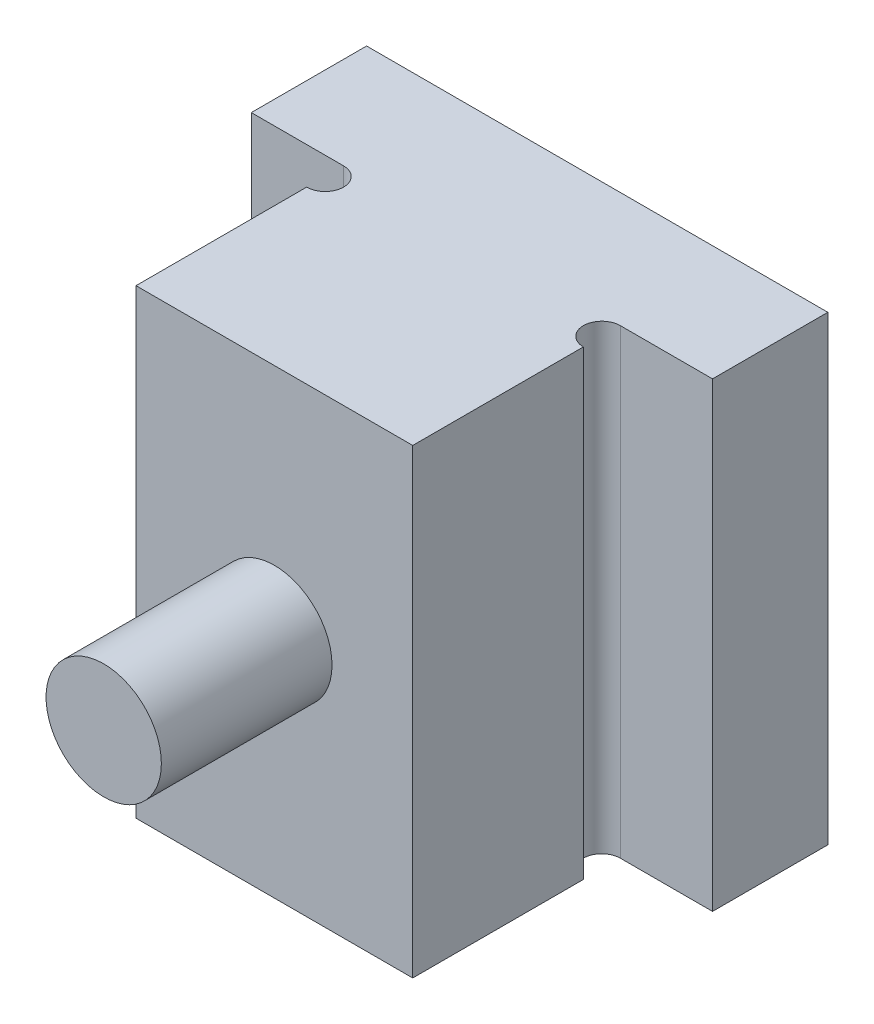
ISO-10303-21;
HEADER;
FILE_DESCRIPTION(('STEP AP214'),'2;1');
FILE_NAME('part.step','',(''),(''),'','','');
FILE_SCHEMA(('AUTOMOTIVE_DESIGN { 1 0 10303 214 1 1 1 1 }'));
ENDSEC;
DATA;
#1=APPLICATION_CONTEXT('core data for automotive mechanical design processes');
#2=APPLICATION_PROTOCOL_DEFINITION('international standard','automotive_design',2000,#1);
#3=PRODUCT_CONTEXT('',#1,'mechanical');
#4=PRODUCT('Part','Part','',(#3));
#5=PRODUCT_RELATED_PRODUCT_CATEGORY('part','',(#4));
#6=PRODUCT_DEFINITION_FORMATION('','',#4);
#7=PRODUCT_DEFINITION_CONTEXT('part definition',#1,'design');
#8=PRODUCT_DEFINITION('design','',#6,#7);
#9=PRODUCT_DEFINITION_SHAPE('','',#8);
#10=(LENGTH_UNIT() NAMED_UNIT(*) SI_UNIT(.MILLI.,.METRE.));
#11=(NAMED_UNIT(*) PLANE_ANGLE_UNIT() SI_UNIT($,.RADIAN.));
#12=(NAMED_UNIT(*) SI_UNIT($,.STERADIAN.) SOLID_ANGLE_UNIT());
#13=UNCERTAINTY_MEASURE_WITH_UNIT(LENGTH_MEASURE(1.E-05),#10,'distance_accuracy_value','');
#14=(GEOMETRIC_REPRESENTATION_CONTEXT(3) GLOBAL_UNCERTAINTY_ASSIGNED_CONTEXT((#13)) GLOBAL_UNIT_ASSIGNED_CONTEXT((#10,
#11,#12)) REPRESENTATION_CONTEXT('',''));
#15=CARTESIAN_POINT('',(0.,0.,0.));
#16=DIRECTION('',(0.,0.,1.));
#17=DIRECTION('',(1.,0.,0.));
#18=AXIS2_PLACEMENT_3D('',#15,#16,#17);
#19=CARTESIAN_POINT('',(-1.15470053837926,2.,-10.05));
#20=DIRECTION('',(0.,0.,1.));
#21=DIRECTION('',(-1.,0.,0.));
#22=AXIS2_PLACEMENT_3D('',#19,#20,#21);
#23=PLANE('',#22);
#24=DIRECTION('',(1.,0.,0.));
#25=VECTOR('',#24,1.);
#26=CARTESIAN_POINT('',(-1.15470053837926,2.,-10.05));
#27=LINE('',#26,#25);
#28=CARTESIAN_POINT('',(-1.15470053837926,2.,-10.05));
#29=VERTEX_POINT('',#28);
#30=CARTESIAN_POINT('',(1.15470053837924,2.,-10.05));
#31=VERTEX_POINT('',#30);
#32=EDGE_CURVE('E128',#29,#31,#27,.T.);
#33=ORIENTED_EDGE('',*,*,#32,.T.);
#34=DIRECTION('',(0.5,-0.866025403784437,0.));
#35=VECTOR('',#34,1.);
#36=CARTESIAN_POINT('',(1.15470053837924,2.,-10.05));
#37=LINE('',#36,#35);
#38=CARTESIAN_POINT('',(2.3094010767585,0.,-10.05));
#39=VERTEX_POINT('',#38);
#40=EDGE_CURVE('E133',#31,#39,#37,.T.);
#41=ORIENTED_EDGE('',*,*,#40,.T.);
#42=DIRECTION('',(0.5,0.866025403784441,0.));
#43=VECTOR('',#42,1.);
#44=CARTESIAN_POINT('',(1.15470053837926,-2.,-10.05));
#45=LINE('',#44,#43);
#46=CARTESIAN_POINT('',(1.15470053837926,-2.,-10.05));
#47=VERTEX_POINT('',#46);
#48=EDGE_CURVE('E184',#47,#39,#45,.T.);
#49=ORIENTED_EDGE('',*,*,#48,.F.);
#50=DIRECTION('',(1.,0.,0.));
#51=VECTOR('',#50,1.);
#52=CARTESIAN_POINT('',(-1.15470053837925,-2.,-10.05));
#53=LINE('',#52,#51);
#54=CARTESIAN_POINT('',(-1.15470053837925,-2.,-10.05));
#55=VERTEX_POINT('',#54);
#56=EDGE_CURVE('E149',#55,#47,#53,.T.);
#57=ORIENTED_EDGE('',*,*,#56,.F.);
#58=DIRECTION('',(-0.5,0.866025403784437,0.));
#59=VECTOR('',#58,1.);
#60=CARTESIAN_POINT('',(-1.15470053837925,-2.,-10.05));
#61=LINE('',#60,#59);
#62=CARTESIAN_POINT('',(-2.30940107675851,0.,-10.05));
#63=VERTEX_POINT('',#62);
#64=EDGE_CURVE('E144',#55,#63,#61,.T.);
#65=ORIENTED_EDGE('',*,*,#64,.T.);
#66=DIRECTION('',(-0.5,-0.866025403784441,0.));
#67=VECTOR('',#66,1.);
#68=CARTESIAN_POINT('',(-1.15470053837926,2.,-10.05));
#69=LINE('',#68,#67);
#70=EDGE_CURVE('E146',#29,#63,#69,.T.);
#71=ORIENTED_EDGE('',*,*,#70,.F.);
#72=EDGE_LOOP('',(#33,#41,#49,#57,#65,#71));
#73=FACE_BOUND('',#72,.T.);
#74=ADVANCED_FACE('F16',(#73),#23,.F.);
#75=CARTESIAN_POINT('',(-1.15470053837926,2.,-10.05));
#76=DIRECTION('',(0.866025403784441,-0.5,0.));
#77=DIRECTION('',(-0.5,-0.866025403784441,0.));
#78=AXIS2_PLACEMENT_3D('',#75,#76,#77);
#79=PLANE('',#78);
#80=ORIENTED_EDGE('',*,*,#70,.T.);
#81=DIRECTION('',(0.,0.,-1.));
#82=VECTOR('',#81,1.);
#83=CARTESIAN_POINT('',(-2.30940107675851,0.,-10.05));
#84=LINE('',#83,#82);
#85=CARTESIAN_POINT('',(-2.30940107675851,0.,-13.6));
#86=VERTEX_POINT('',#85);
#87=EDGE_CURVE('E155',#63,#86,#84,.T.);
#88=ORIENTED_EDGE('',*,*,#87,.T.);
#89=DIRECTION('',(0.5,0.86602540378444,0.));
#90=VECTOR('',#89,1.);
#91=CARTESIAN_POINT('',(-2.30940107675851,0.,-13.6));
#92=LINE('',#91,#90);
#93=CARTESIAN_POINT('',(-1.15470053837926,2.,-13.6));
#94=VERTEX_POINT('',#93);
#95=EDGE_CURVE('E200',#86,#94,#92,.T.);
#96=ORIENTED_EDGE('',*,*,#95,.T.);
#97=DIRECTION('',(0.,0.,-1.));
#98=VECTOR('',#97,1.);
#99=CARTESIAN_POINT('',(-1.15470053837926,2.,-10.05));
#100=LINE('',#99,#98);
#101=EDGE_CURVE('E152',#94,#29,#100,.F.);
#102=ORIENTED_EDGE('',*,*,#101,.T.);
#103=EDGE_LOOP('',(#80,#88,#96,#102));
#104=FACE_BOUND('',#103,.T.);
#105=ADVANCED_FACE('F163',(#104),#79,.T.);
#106=CARTESIAN_POINT('',(-1.15470053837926,2.,-10.05));
#107=DIRECTION('',(0.,1.,0.));
#108=DIRECTION('',(1.,0.,0.));
#109=AXIS2_PLACEMENT_3D('',#106,#107,#108);
#110=PLANE('',#109);
#111=DIRECTION('',(0.,0.,-1.));
#112=VECTOR('',#111,1.);
#113=CARTESIAN_POINT('',(1.15470053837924,2.,-10.05));
#114=LINE('',#113,#112);
#115=CARTESIAN_POINT('',(1.15470053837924,2.,-13.6));
#116=VERTEX_POINT('',#115);
#117=EDGE_CURVE('E190',#116,#31,#114,.F.);
#118=ORIENTED_EDGE('',*,*,#117,.T.);
#119=ORIENTED_EDGE('',*,*,#32,.F.);
#120=ORIENTED_EDGE('',*,*,#101,.F.);
#121=DIRECTION('',(-1.,0.,0.));
#122=VECTOR('',#121,1.);
#123=CARTESIAN_POINT('',(0.,2.,-13.6));
#124=LINE('',#123,#122);
#125=EDGE_CURVE('E161',#94,#116,#124,.F.);
#126=ORIENTED_EDGE('',*,*,#125,.T.);
#127=EDGE_LOOP('',(#118,#119,#120,#126));
#128=FACE_BOUND('',#127,.T.);
#129=ADVANCED_FACE('F342',(#128),#110,.F.);
#130=CARTESIAN_POINT('',(1.15470053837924,2.,-10.05));
#131=DIRECTION('',(0.866025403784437,0.5,0.));
#132=DIRECTION('',(0.5,-0.866025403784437,0.));
#133=AXIS2_PLACEMENT_3D('',#130,#131,#132);
#134=PLANE('',#133);
#135=DIRECTION('',(0.,0.,-1.));
#136=VECTOR('',#135,1.);
#137=CARTESIAN_POINT('',(2.3094010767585,0.,-10.05));
#138=LINE('',#137,#136);
#139=CARTESIAN_POINT('',(2.3094010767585,0.,-13.6));
#140=VERTEX_POINT('',#139);
#141=EDGE_CURVE('E180',#39,#140,#138,.T.);
#142=ORIENTED_EDGE('',*,*,#141,.F.);
#143=ORIENTED_EDGE('',*,*,#40,.F.);
#144=ORIENTED_EDGE('',*,*,#117,.F.);
#145=DIRECTION('',(0.5,-0.866025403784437,0.));
#146=VECTOR('',#145,1.);
#147=CARTESIAN_POINT('',(1.15470053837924,2.,-13.6));
#148=LINE('',#147,#146);
#149=EDGE_CURVE('E593',#116,#140,#148,.T.);
#150=ORIENTED_EDGE('',*,*,#149,.T.);
#151=EDGE_LOOP('',(#142,#143,#144,#150));
#152=FACE_BOUND('',#151,.T.);
#153=ADVANCED_FACE('F545',(#152),#134,.F.);
#154=CARTESIAN_POINT('',(1.15470053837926,-2.,-10.05));
#155=DIRECTION('',(-0.866025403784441,0.5,0.));
#156=DIRECTION('',(0.5,0.866025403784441,0.));
#157=AXIS2_PLACEMENT_3D('',#154,#155,#156);
#158=PLANE('',#157);
#159=ORIENTED_EDGE('',*,*,#48,.T.);
#160=ORIENTED_EDGE('',*,*,#141,.T.);
#161=DIRECTION('',(-0.5,-0.866025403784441,0.));
#162=VECTOR('',#161,1.);
#163=CARTESIAN_POINT('',(2.3094010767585,0.,-13.6));
#164=LINE('',#163,#162);
#165=CARTESIAN_POINT('',(1.15470053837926,-2.,-13.6));
#166=VERTEX_POINT('',#165);
#167=EDGE_CURVE('E596',#140,#166,#164,.T.);
#168=ORIENTED_EDGE('',*,*,#167,.T.);
#169=DIRECTION('',(0.,0.,-1.));
#170=VECTOR('',#169,1.);
#171=CARTESIAN_POINT('',(1.15470053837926,-2.,-10.05));
#172=LINE('',#171,#170);
#173=EDGE_CURVE('E174',#47,#166,#172,.T.);
#174=ORIENTED_EDGE('',*,*,#173,.F.);
#175=EDGE_LOOP('',(#159,#160,#168,#174));
#176=FACE_BOUND('',#175,.T.);
#177=ADVANCED_FACE('F536',(#176),#158,.T.);
#178=CARTESIAN_POINT('',(-1.15470053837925,-2.,-10.05));
#179=DIRECTION('',(0.,1.,0.));
#180=DIRECTION('',(1.,0.,0.));
#181=AXIS2_PLACEMENT_3D('',#178,#179,#180);
#182=PLANE('',#181);
#183=ORIENTED_EDGE('',*,*,#56,.T.);
#184=ORIENTED_EDGE('',*,*,#173,.T.);
#185=DIRECTION('',(-1.,0.,0.));
#186=VECTOR('',#185,1.);
#187=CARTESIAN_POINT('',(0.,-2.,-13.6));
#188=LINE('',#187,#186);
#189=CARTESIAN_POINT('',(-1.15470053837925,-2.,-13.6));
#190=VERTEX_POINT('',#189);
#191=EDGE_CURVE('E598',#166,#190,#188,.T.);
#192=ORIENTED_EDGE('',*,*,#191,.T.);
#193=DIRECTION('',(0.,0.,-1.));
#194=VECTOR('',#193,1.);
#195=CARTESIAN_POINT('',(-1.15470053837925,-2.,-10.05));
#196=LINE('',#195,#194);
#197=EDGE_CURVE('E153',#190,#55,#196,.F.);
#198=ORIENTED_EDGE('',*,*,#197,.T.);
#199=EDGE_LOOP('',(#183,#184,#192,#198));
#200=FACE_BOUND('',#199,.T.);
#201=ADVANCED_FACE('F528',(#200),#182,.T.);
#202=CARTESIAN_POINT('',(-1.15470053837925,-2.,-10.05));
#203=DIRECTION('',(-0.866025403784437,-0.5,0.));
#204=DIRECTION('',(-0.5,0.866025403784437,0.));
#205=AXIS2_PLACEMENT_3D('',#202,#203,#204);
#206=PLANE('',#205);
#207=ORIENTED_EDGE('',*,*,#87,.F.);
#208=ORIENTED_EDGE('',*,*,#64,.F.);
#209=ORIENTED_EDGE('',*,*,#197,.F.);
#210=DIRECTION('',(-0.5,0.866025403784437,0.));
#211=VECTOR('',#210,1.);
#212=CARTESIAN_POINT('',(-1.15470053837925,-2.,-13.6));
#213=LINE('',#212,#211);
#214=EDGE_CURVE('E36',#190,#86,#213,.T.);
#215=ORIENTED_EDGE('',*,*,#214,.T.);
#216=EDGE_LOOP('',(#207,#208,#209,#215));
#217=FACE_BOUND('',#216,.T.);
#218=ADVANCED_FACE('F156',(#217),#206,.F.);
#219=CARTESIAN_POINT('',(0.,-4.05,-13.6));
#220=DIRECTION('',(0.,0.,1.));
#221=DIRECTION('',(-1.,0.,0.));
#222=AXIS2_PLACEMENT_3D('',#219,#220,#221);
#223=PLANE('',#222);
#224=CARTESIAN_POINT('',(0.,0.,-13.6));
#225=DIRECTION('',(0.,0.,1.));
#226=DIRECTION('',(-1.,0.,0.));
#227=AXIS2_PLACEMENT_3D('',#224,#225,#226);
#228=CIRCLE('',#227,4.25);
#229=CARTESIAN_POINT('',(-4.25,0.,-13.6));
#230=VERTEX_POINT('',#229);
#231=EDGE_CURVE('E199',#230,#230,#228,.T.);
#232=ORIENTED_EDGE('',*,*,#231,.F.);
#233=EDGE_LOOP('',(#232));
#234=FACE_BOUND('',#233,.T.);
#235=ORIENTED_EDGE('',*,*,#214,.F.);
#236=ORIENTED_EDGE('',*,*,#191,.F.);
#237=ORIENTED_EDGE('',*,*,#167,.F.);
#238=ORIENTED_EDGE('',*,*,#149,.F.);
#239=ORIENTED_EDGE('',*,*,#125,.F.);
#240=ORIENTED_EDGE('',*,*,#95,.F.);
#241=EDGE_LOOP('',(#235,#236,#237,#238,#239,#240));
#242=FACE_BOUND('',#241,.T.);
#243=ADVANCED_FACE('F347',(#234,#242),#223,.F.);
#244=CARTESIAN_POINT('',(0.,0.,-8.6));
#245=DIRECTION('',(0.,0.,-1.));
#246=DIRECTION('',(1.,0.,0.));
#247=AXIS2_PLACEMENT_3D('',#244,#245,#246);
#248=CYLINDRICAL_SURFACE('',#247,4.25);
#249=CARTESIAN_POINT('',(0.,0.,-8.6));
#250=DIRECTION('',(0.,0.,-1.));
#251=DIRECTION('',(1.,0.,0.));
#252=AXIS2_PLACEMENT_3D('',#249,#250,#251);
#253=CIRCLE('',#252,4.25);
#254=CARTESIAN_POINT('',(4.25,0.,-8.6));
#255=VERTEX_POINT('',#254);
#256=EDGE_CURVE('E195',#255,#255,#253,.T.);
#257=ORIENTED_EDGE('',*,*,#256,.T.);
#258=EDGE_LOOP('',(#257));
#259=FACE_BOUND('',#258,.T.);
#260=ORIENTED_EDGE('',*,*,#231,.T.);
#261=EDGE_LOOP('',(#260));
#262=FACE_BOUND('',#261,.T.);
#263=ADVANCED_FACE('F350',(#259,#262),#248,.T.);
#264=CARTESIAN_POINT('',(10.,-9.99999999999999,-14.));
#265=DIRECTION('',(-1.,0.,0.));
#266=DIRECTION('',(0.,0.,-1.));
#267=AXIS2_PLACEMENT_3D('',#264,#265,#266);
#268=PLANE('',#267);
#269=DIRECTION('',(0.,0.,1.));
#270=VECTOR('',#269,1.);
#271=CARTESIAN_POINT('',(10.,-9.99999999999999,-14.));
#272=LINE('',#271,#270);
#273=CARTESIAN_POINT('',(10.,-9.99999999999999,-9.));
#274=VERTEX_POINT('',#273);
#275=CARTESIAN_POINT('',(10.,-9.99999999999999,-14.));
#276=VERTEX_POINT('',#275);
#277=EDGE_CURVE('E266',#274,#276,#272,.F.);
#278=ORIENTED_EDGE('',*,*,#277,.T.);
#279=DIRECTION('',(0.,1.,0.));
#280=VECTOR('',#279,1.);
#281=CARTESIAN_POINT('',(10.,-9.99999999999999,-14.));
#282=LINE('',#281,#280);
#283=CARTESIAN_POINT('',(10.,9.99999999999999,-14.));
#284=VERTEX_POINT('',#283);
#285=EDGE_CURVE('E297',#276,#284,#282,.T.);
#286=ORIENTED_EDGE('',*,*,#285,.T.);
#287=DIRECTION('',(0.,0.,-1.));
#288=VECTOR('',#287,1.);
#289=CARTESIAN_POINT('',(10.,9.99999999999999,-14.));
#290=LINE('',#289,#288);
#291=CARTESIAN_POINT('',(10.,9.99999999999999,-9.));
#292=VERTEX_POINT('',#291);
#293=EDGE_CURVE('E262',#292,#284,#290,.T.);
#294=ORIENTED_EDGE('',*,*,#293,.F.);
#295=DIRECTION('',(0.,-1.,0.));
#296=VECTOR('',#295,1.);
#297=CARTESIAN_POINT('',(10.,-9.99999999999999,-9.));
#298=LINE('',#297,#296);
#299=EDGE_CURVE('E225',#274,#292,#298,.F.);
#300=ORIENTED_EDGE('',*,*,#299,.F.);
#301=EDGE_LOOP('',(#278,#286,#294,#300));
#302=FACE_BOUND('',#301,.T.);
#303=ADVANCED_FACE('F354',(#302),#268,.F.);
#304=CARTESIAN_POINT('',(6.,9.99999999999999,-9.));
#305=DIRECTION('',(0.,0.,-1.));
#306=DIRECTION('',(1.,0.,0.));
#307=AXIS2_PLACEMENT_3D('',#304,#305,#306);
#308=PLANE('',#307);
#309=DIRECTION('',(1.,0.,0.));
#310=VECTOR('',#309,1.);
#311=CARTESIAN_POINT('',(6.,9.99999999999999,-9.));
#312=LINE('',#311,#310);
#313=CARTESIAN_POINT('',(6.,9.99999999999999,-9.));
#314=VERTEX_POINT('',#313);
#315=EDGE_CURVE('E221',#314,#292,#312,.T.);
#316=ORIENTED_EDGE('',*,*,#315,.F.);
#317=DIRECTION('',(0.,-1.,0.));
#318=VECTOR('',#317,1.);
#319=CARTESIAN_POINT('',(6.,9.99999999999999,-9.));
#320=LINE('',#319,#318);
#321=CARTESIAN_POINT('',(6.,-9.99999999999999,-9.));
#322=VERTEX_POINT('',#321);
#323=EDGE_CURVE('E231',#322,#314,#320,.F.);
#324=ORIENTED_EDGE('',*,*,#323,.F.);
#325=DIRECTION('',(1.,0.,0.));
#326=VECTOR('',#325,1.);
#327=CARTESIAN_POINT('',(6.,-9.99999999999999,-9.));
#328=LINE('',#327,#326);
#329=EDGE_CURVE('E212',#322,#274,#328,.T.);
#330=ORIENTED_EDGE('',*,*,#329,.T.);
#331=ORIENTED_EDGE('',*,*,#299,.T.);
#332=EDGE_LOOP('',(#316,#324,#330,#331));
#333=FACE_BOUND('',#332,.T.);
#334=ADVANCED_FACE('F370',(#333),#308,.F.);
#335=CARTESIAN_POINT('',(-6.,9.99999999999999,-8.2));
#336=DIRECTION('',(0.,-1.,0.));
#337=DIRECTION('',(-1.,0.,0.));
#338=AXIS2_PLACEMENT_3D('',#335,#336,#337);
#339=CYLINDRICAL_SURFACE('',#338,0.8);
#340=CARTESIAN_POINT('',(-6.,9.99999999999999,-8.2));
#341=DIRECTION('',(0.,-1.,0.));
#342=DIRECTION('',(-1.,0.,0.));
#343=AXIS2_PLACEMENT_3D('',#340,#341,#342);
#344=CIRCLE('',#343,0.8);
#345=CARTESIAN_POINT('',(-6.,9.99999999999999,-9.));
#346=VERTEX_POINT('',#345);
#347=CARTESIAN_POINT('',(-6.,9.99999999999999,-7.4));
#348=VERTEX_POINT('',#347);
#349=EDGE_CURVE('E280',#346,#348,#344,.T.);
#350=ORIENTED_EDGE('',*,*,#349,.F.);
#351=DIRECTION('',(0.,-1.,0.));
#352=VECTOR('',#351,1.);
#353=CARTESIAN_POINT('',(-6.,9.99999999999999,-9.));
#354=LINE('',#353,#352);
#355=CARTESIAN_POINT('',(-6.,-9.99999999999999,-9.));
#356=VERTEX_POINT('',#355);
#357=EDGE_CURVE('E226',#346,#356,#354,.T.);
#358=ORIENTED_EDGE('',*,*,#357,.T.);
#359=CARTESIAN_POINT('',(-6.,-9.99999999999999,-8.2));
#360=DIRECTION('',(0.,-1.,0.));
#361=DIRECTION('',(-1.,0.,0.));
#362=AXIS2_PLACEMENT_3D('',#359,#360,#361);
#363=CIRCLE('',#362,0.8);
#364=CARTESIAN_POINT('',(-6.,-9.99999999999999,-7.4));
#365=VERTEX_POINT('',#364);
#366=EDGE_CURVE('E274',#365,#356,#363,.F.);
#367=ORIENTED_EDGE('',*,*,#366,.F.);
#368=DIRECTION('',(0.,-1.,0.));
#369=VECTOR('',#368,1.);
#370=CARTESIAN_POINT('',(-6.,-9.99999999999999,-7.4));
#371=LINE('',#370,#369);
#372=EDGE_CURVE('E235',#365,#348,#371,.F.);
#373=ORIENTED_EDGE('',*,*,#372,.T.);
#374=EDGE_LOOP('',(#350,#358,#367,#373));
#375=FACE_BOUND('',#374,.T.);
#376=ADVANCED_FACE('F368',(#375),#339,.F.);
#377=CARTESIAN_POINT('',(-12.,9.99999999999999,-9.));
#378=DIRECTION('',(0.,0.,-1.));
#379=DIRECTION('',(1.,0.,0.));
#380=AXIS2_PLACEMENT_3D('',#377,#378,#379);
#381=PLANE('',#380);
#382=DIRECTION('',(0.,-1.,0.));
#383=VECTOR('',#382,1.);
#384=CARTESIAN_POINT('',(-10.,-9.99999999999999,-9.));
#385=LINE('',#384,#383);
#386=CARTESIAN_POINT('',(-10.,9.99999999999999,-9.));
#387=VERTEX_POINT('',#386);
#388=CARTESIAN_POINT('',(-10.,-9.99999999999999,-9.));
#389=VERTEX_POINT('',#388);
#390=EDGE_CURVE('E216',#387,#389,#385,.T.);
#391=ORIENTED_EDGE('',*,*,#390,.T.);
#392=DIRECTION('',(1.,0.,0.));
#393=VECTOR('',#392,1.);
#394=CARTESIAN_POINT('',(6.,-9.99999999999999,-9.));
#395=LINE('',#394,#393);
#396=EDGE_CURVE('E207',#389,#356,#395,.T.);
#397=ORIENTED_EDGE('',*,*,#396,.T.);
#398=ORIENTED_EDGE('',*,*,#357,.F.);
#399=DIRECTION('',(1.,0.,0.));
#400=VECTOR('',#399,1.);
#401=CARTESIAN_POINT('',(6.,9.99999999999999,-9.));
#402=LINE('',#401,#400);
#403=EDGE_CURVE('E217',#387,#346,#402,.T.);
#404=ORIENTED_EDGE('',*,*,#403,.F.);
#405=EDGE_LOOP('',(#391,#397,#398,#404));
#406=FACE_BOUND('',#405,.T.);
#407=ADVANCED_FACE('F365',(#406),#381,.F.);
#408=CARTESIAN_POINT('',(-10.,-9.99999999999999,-14.));
#409=DIRECTION('',(1.,0.,0.));
#410=DIRECTION('',(0.,0.,1.));
#411=AXIS2_PLACEMENT_3D('',#408,#409,#410);
#412=PLANE('',#411);
#413=DIRECTION('',(0.,0.,-1.));
#414=VECTOR('',#413,1.);
#415=CARTESIAN_POINT('',(-10.,9.99999999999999,-14.));
#416=LINE('',#415,#414);
#417=CARTESIAN_POINT('',(-10.,9.99999999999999,-14.));
#418=VERTEX_POINT('',#417);
#419=EDGE_CURVE('E253',#387,#418,#416,.T.);
#420=ORIENTED_EDGE('',*,*,#419,.T.);
#421=DIRECTION('',(0.,-1.,0.));
#422=VECTOR('',#421,1.);
#423=CARTESIAN_POINT('',(-10.,-9.99999999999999,-14.));
#424=LINE('',#423,#422);
#425=CARTESIAN_POINT('',(-10.,-9.99999999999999,-14.));
#426=VERTEX_POINT('',#425);
#427=EDGE_CURVE('E120',#418,#426,#424,.T.);
#428=ORIENTED_EDGE('',*,*,#427,.T.);
#429=DIRECTION('',(0.,0.,1.));
#430=VECTOR('',#429,1.);
#431=CARTESIAN_POINT('',(-10.,-9.99999999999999,-14.));
#432=LINE('',#431,#430);
#433=EDGE_CURVE('E246',#389,#426,#432,.F.);
#434=ORIENTED_EDGE('',*,*,#433,.F.);
#435=ORIENTED_EDGE('',*,*,#390,.F.);
#436=EDGE_LOOP('',(#420,#428,#434,#435));
#437=FACE_BOUND('',#436,.T.);
#438=ADVANCED_FACE('F334',(#437),#412,.F.);
#439=CARTESIAN_POINT('',(10.,-9.99999999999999,-14.));
#440=DIRECTION('',(0.,0.,1.));
#441=DIRECTION('',(-1.,0.,0.));
#442=AXIS2_PLACEMENT_3D('',#439,#440,#441);
#443=PLANE('',#442);
#444=ORIENTED_EDGE('',*,*,#285,.F.);
#445=DIRECTION('',(-1.,0.,0.));
#446=VECTOR('',#445,1.);
#447=CARTESIAN_POINT('',(10.,-9.99999999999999,-14.));
#448=LINE('',#447,#446);
#449=EDGE_CURVE('E311',#276,#426,#448,.T.);
#450=ORIENTED_EDGE('',*,*,#449,.T.);
#451=ORIENTED_EDGE('',*,*,#427,.F.);
#452=DIRECTION('',(1.,0.,0.));
#453=VECTOR('',#452,1.);
#454=CARTESIAN_POINT('',(6.,9.99999999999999,-14.));
#455=LINE('',#454,#453);
#456=EDGE_CURVE('E294',#418,#284,#455,.T.);
#457=ORIENTED_EDGE('',*,*,#456,.T.);
#458=EDGE_LOOP('',(#444,#450,#451,#457));
#459=FACE_BOUND('',#458,.T.);
#460=CARTESIAN_POINT('',(0.,0.,-14.));
#461=DIRECTION('',(0.,0.,1.));
#462=DIRECTION('',(-1.,0.,0.));
#463=AXIS2_PLACEMENT_3D('',#460,#461,#462);
#464=CIRCLE('',#463,5.);
#465=CARTESIAN_POINT('',(-5.,0.,-14.));
#466=VERTEX_POINT('',#465);
#467=EDGE_CURVE('E20',#466,#466,#464,.T.);
#468=ORIENTED_EDGE('',*,*,#467,.T.);
#469=EDGE_LOOP('',(#468));
#470=FACE_BOUND('',#469,.T.);
#471=ADVANCED_FACE('F321',(#459,#470),#443,.F.);
#472=CARTESIAN_POINT('',(0.,0.,-14.));
#473=DIRECTION('',(0.,0.,-1.));
#474=DIRECTION('',(1.,0.,0.));
#475=AXIS2_PLACEMENT_3D('',#472,#473,#474);
#476=CYLINDRICAL_SURFACE('',#475,5.);
#477=CARTESIAN_POINT('',(0.,0.,-8.6));
#478=DIRECTION('',(0.,0.,-1.));
#479=DIRECTION('',(1.,0.,0.));
#480=AXIS2_PLACEMENT_3D('',#477,#478,#479);
#481=CIRCLE('',#480,5.);
#482=CARTESIAN_POINT('',(5.,0.,-8.6));
#483=VERTEX_POINT('',#482);
#484=EDGE_CURVE('E230',#483,#483,#481,.T.);
#485=ORIENTED_EDGE('',*,*,#484,.F.);
#486=EDGE_LOOP('',(#485));
#487=FACE_BOUND('',#486,.T.);
#488=ORIENTED_EDGE('',*,*,#467,.F.);
#489=EDGE_LOOP('',(#488));
#490=FACE_BOUND('',#489,.T.);
#491=ADVANCED_FACE('F18',(#487,#490),#476,.F.);
#492=CARTESIAN_POINT('',(0.,-5.,-8.6));
#493=DIRECTION('',(0.,0.,1.));
#494=DIRECTION('',(-1.,0.,0.));
#495=AXIS2_PLACEMENT_3D('',#492,#493,#494);
#496=PLANE('',#495);
#497=ORIENTED_EDGE('',*,*,#256,.F.);
#498=EDGE_LOOP('',(#497));
#499=FACE_BOUND('',#498,.T.);
#500=ORIENTED_EDGE('',*,*,#484,.T.);
#501=EDGE_LOOP('',(#500));
#502=FACE_BOUND('',#501,.T.);
#503=ADVANCED_FACE('F324',(#499,#502),#496,.F.);
#504=CARTESIAN_POINT('',(6.,9.99999999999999,-8.2));
#505=DIRECTION('',(0.,-1.,0.));
#506=DIRECTION('',(-1.,0.,0.));
#507=AXIS2_PLACEMENT_3D('',#504,#505,#506);
#508=CYLINDRICAL_SURFACE('',#507,0.8);
#509=CARTESIAN_POINT('',(6.,9.99999999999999,-8.2));
#510=DIRECTION('',(0.,-1.,0.));
#511=DIRECTION('',(-1.,0.,0.));
#512=AXIS2_PLACEMENT_3D('',#509,#510,#511);
#513=CIRCLE('',#512,0.8);
#514=CARTESIAN_POINT('',(6.,9.99999999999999,-7.4));
#515=VERTEX_POINT('',#514);
#516=EDGE_CURVE('E271',#515,#314,#513,.T.);
#517=ORIENTED_EDGE('',*,*,#516,.F.);
#518=DIRECTION('',(0.,1.,0.));
#519=VECTOR('',#518,1.);
#520=CARTESIAN_POINT('',(6.,-9.99999999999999,-7.4));
#521=LINE('',#520,#519);
#522=CARTESIAN_POINT('',(6.,-9.99999999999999,-7.4));
#523=VERTEX_POINT('',#522);
#524=EDGE_CURVE('E276',#515,#523,#521,.F.);
#525=ORIENTED_EDGE('',*,*,#524,.T.);
#526=CARTESIAN_POINT('',(6.,-9.99999999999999,-8.2));
#527=DIRECTION('',(0.,-1.,0.));
#528=DIRECTION('',(-1.,0.,0.));
#529=AXIS2_PLACEMENT_3D('',#526,#527,#528);
#530=CIRCLE('',#529,0.8);
#531=EDGE_CURVE('E275',#322,#523,#530,.F.);
#532=ORIENTED_EDGE('',*,*,#531,.F.);
#533=ORIENTED_EDGE('',*,*,#323,.T.);
#534=EDGE_LOOP('',(#517,#525,#532,#533));
#535=FACE_BOUND('',#534,.T.);
#536=ADVANCED_FACE('F331',(#535),#508,.F.);
#537=CARTESIAN_POINT('',(6.,-9.99999999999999,-14.));
#538=DIRECTION('',(0.,1.,0.));
#539=DIRECTION('',(1.,0.,0.));
#540=AXIS2_PLACEMENT_3D('',#537,#538,#539);
#541=PLANE('',#540);
#542=ORIENTED_EDGE('',*,*,#449,.F.);
#543=ORIENTED_EDGE('',*,*,#277,.F.);
#544=ORIENTED_EDGE('',*,*,#329,.F.);
#545=ORIENTED_EDGE('',*,*,#531,.T.);
#546=DIRECTION('',(0.,0.,1.));
#547=VECTOR('',#546,1.);
#548=CARTESIAN_POINT('',(6.,-9.99999999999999,-14.));
#549=LINE('',#548,#547);
#550=CARTESIAN_POINT('',(6.,-9.99999999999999,0.));
#551=VERTEX_POINT('',#550);
#552=EDGE_CURVE('E211',#551,#523,#549,.F.);
#553=ORIENTED_EDGE('',*,*,#552,.F.);
#554=DIRECTION('',(-1.,0.,0.));
#555=VECTOR('',#554,1.);
#556=CARTESIAN_POINT('',(6.,-9.99999999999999,0.));
#557=LINE('',#556,#555);
#558=CARTESIAN_POINT('',(-6.,-9.99999999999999,0.));
#559=VERTEX_POINT('',#558);
#560=EDGE_CURVE('E301',#551,#559,#557,.T.);
#561=ORIENTED_EDGE('',*,*,#560,.T.);
#562=DIRECTION('',(0.,0.,1.));
#563=VECTOR('',#562,1.);
#564=CARTESIAN_POINT('',(-6.,-9.99999999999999,0.));
#565=LINE('',#564,#563);
#566=EDGE_CURVE('E250',#559,#365,#565,.F.);
#567=ORIENTED_EDGE('',*,*,#566,.T.);
#568=ORIENTED_EDGE('',*,*,#366,.T.);
#569=ORIENTED_EDGE('',*,*,#396,.F.);
#570=ORIENTED_EDGE('',*,*,#433,.T.);
#571=EDGE_LOOP('',(#542,#543,#544,#545,#553,#561,#567,#568,#569,#570));
#572=FACE_BOUND('',#571,.T.);
#573=ADVANCED_FACE('F379',(#572),#541,.F.);
#574=CARTESIAN_POINT('',(-6.,-9.99999999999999,0.));
#575=DIRECTION('',(1.,0.,0.));
#576=DIRECTION('',(0.,0.,1.));
#577=AXIS2_PLACEMENT_3D('',#574,#575,#576);
#578=PLANE('',#577);
#579=ORIENTED_EDGE('',*,*,#566,.F.);
#580=DIRECTION('',(0.,1.,0.));
#581=VECTOR('',#580,1.);
#582=CARTESIAN_POINT('',(-6.,-9.99999999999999,0.));
#583=LINE('',#582,#581);
#584=CARTESIAN_POINT('',(-6.,9.99999999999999,0.));
#585=VERTEX_POINT('',#584);
#586=EDGE_CURVE('E114',#559,#585,#583,.T.);
#587=ORIENTED_EDGE('',*,*,#586,.T.);
#588=DIRECTION('',(0.,0.,-1.));
#589=VECTOR('',#588,1.);
#590=CARTESIAN_POINT('',(-6.,9.99999999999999,-14.));
#591=LINE('',#590,#589);
#592=EDGE_CURVE('E256',#585,#348,#591,.T.);
#593=ORIENTED_EDGE('',*,*,#592,.T.);
#594=ORIENTED_EDGE('',*,*,#372,.F.);
#595=EDGE_LOOP('',(#579,#587,#593,#594));
#596=FACE_BOUND('',#595,.T.);
#597=ADVANCED_FACE('F388',(#596),#578,.F.);
#598=CARTESIAN_POINT('',(6.,9.99999999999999,-14.));
#599=DIRECTION('',(0.,1.,0.));
#600=DIRECTION('',(1.,0.,0.));
#601=AXIS2_PLACEMENT_3D('',#598,#599,#600);
#602=PLANE('',#601);
#603=ORIENTED_EDGE('',*,*,#456,.F.);
#604=ORIENTED_EDGE('',*,*,#419,.F.);
#605=ORIENTED_EDGE('',*,*,#403,.T.);
#606=ORIENTED_EDGE('',*,*,#349,.T.);
#607=ORIENTED_EDGE('',*,*,#592,.F.);
#608=DIRECTION('',(-1.,0.,0.));
#609=VECTOR('',#608,1.);
#610=CARTESIAN_POINT('',(6.,9.99999999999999,0.));
#611=LINE('',#610,#609);
#612=CARTESIAN_POINT('',(6.,9.99999999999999,0.));
#613=VERTEX_POINT('',#612);
#614=EDGE_CURVE('E270',#613,#585,#611,.T.);
#615=ORIENTED_EDGE('',*,*,#614,.F.);
#616=DIRECTION('',(0.,0.,-1.));
#617=VECTOR('',#616,1.);
#618=CARTESIAN_POINT('',(6.,9.99999999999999,0.));
#619=LINE('',#618,#617);
#620=EDGE_CURVE('E259',#613,#515,#619,.T.);
#621=ORIENTED_EDGE('',*,*,#620,.T.);
#622=ORIENTED_EDGE('',*,*,#516,.T.);
#623=ORIENTED_EDGE('',*,*,#315,.T.);
#624=ORIENTED_EDGE('',*,*,#293,.T.);
#625=EDGE_LOOP('',(#603,#604,#605,#606,#607,#615,#621,#622,#623,#624));
#626=FACE_BOUND('',#625,.T.);
#627=ADVANCED_FACE('F393',(#626),#602,.T.);
#628=CARTESIAN_POINT('',(6.,-9.99999999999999,0.));
#629=DIRECTION('',(-1.,0.,0.));
#630=DIRECTION('',(0.,1.,0.));
#631=AXIS2_PLACEMENT_3D('',#628,#629,#630);
#632=PLANE('',#631);
#633=ORIENTED_EDGE('',*,*,#620,.F.);
#634=DIRECTION('',(0.,-1.,0.));
#635=VECTOR('',#634,1.);
#636=CARTESIAN_POINT('',(6.,-9.99999999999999,0.));
#637=LINE('',#636,#635);
#638=EDGE_CURVE('E308',#613,#551,#637,.T.);
#639=ORIENTED_EDGE('',*,*,#638,.T.);
#640=ORIENTED_EDGE('',*,*,#552,.T.);
#641=ORIENTED_EDGE('',*,*,#524,.F.);
#642=EDGE_LOOP('',(#633,#639,#640,#641));
#643=FACE_BOUND('',#642,.T.);
#644=ADVANCED_FACE('F390',(#643),#632,.F.);
#645=CARTESIAN_POINT('',(6.,-9.99999999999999,0.));
#646=DIRECTION('',(0.,0.,-1.));
#647=DIRECTION('',(1.,0.,0.));
#648=AXIS2_PLACEMENT_3D('',#645,#646,#647);
#649=PLANE('',#648);
#650=CARTESIAN_POINT('',(0.,0.,0.));
#651=DIRECTION('',(0.,0.,-1.));
#652=DIRECTION('',(0.,-1.,0.));
#653=AXIS2_PLACEMENT_3D('',#650,#651,#652);
#654=CIRCLE('',#653,2.5);
#655=CARTESIAN_POINT('',(0.,-2.5,0.));
#656=VERTEX_POINT('',#655);
#657=EDGE_CURVE('E11',#656,#656,#654,.F.);
#658=ORIENTED_EDGE('',*,*,#657,.F.);
#659=EDGE_LOOP('',(#658));
#660=FACE_BOUND('',#659,.T.);
#661=ORIENTED_EDGE('',*,*,#638,.F.);
#662=ORIENTED_EDGE('',*,*,#614,.T.);
#663=ORIENTED_EDGE('',*,*,#586,.F.);
#664=ORIENTED_EDGE('',*,*,#560,.F.);
#665=EDGE_LOOP('',(#661,#662,#663,#664));
#666=FACE_BOUND('',#665,.T.);
#667=ADVANCED_FACE('F363',(#660,#666),#649,.F.);
#668=CARTESIAN_POINT('',(0.,0.,-8.6));
#669=DIRECTION('',(0.,0.,-1.));
#670=DIRECTION('',(1.,0.,0.));
#671=AXIS2_PLACEMENT_3D('',#668,#669,#670);
#672=CYLINDRICAL_SURFACE('',#671,2.5);
#673=CARTESIAN_POINT('',(0.,0.,7.4));
#674=DIRECTION('',(0.,0.,-1.));
#675=DIRECTION('',(1.,0.,0.));
#676=AXIS2_PLACEMENT_3D('',#673,#674,#675);
#677=CIRCLE('',#676,2.5);
#678=CARTESIAN_POINT('',(2.5,0.,7.4));
#679=VERTEX_POINT('',#678);
#680=EDGE_CURVE('E27',#679,#679,#677,.T.);
#681=ORIENTED_EDGE('',*,*,#680,.T.);
#682=EDGE_LOOP('',(#681));
#683=FACE_BOUND('',#682,.T.);
#684=ORIENTED_EDGE('',*,*,#657,.T.);
#685=EDGE_LOOP('',(#684));
#686=FACE_BOUND('',#685,.T.);
#687=ADVANCED_FACE('F359',(#683,#686),#672,.T.);
#688=CARTESIAN_POINT('',(0.,0.,7.4));
#689=DIRECTION('',(0.,0.,-1.));
#690=DIRECTION('',(1.,0.,0.));
#691=AXIS2_PLACEMENT_3D('',#688,#689,#690);
#692=PLANE('',#691);
#693=ORIENTED_EDGE('',*,*,#680,.F.);
#694=EDGE_LOOP('',(#693));
#695=FACE_BOUND('',#694,.T.);
#696=ADVANCED_FACE('F356',(#695),#692,.F.);
#697=CLOSED_SHELL('',(#74,#105,#129,#153,#177,#201,#218,#243,#263,#303,#334,#376,#407,#438,#471,
#491,#503,#536,#573,#597,#627,#644,#667,#687,#696));
#698=MANIFOLD_SOLID_BREP('B1',#697);
#699=ADVANCED_BREP_SHAPE_REPRESENTATION('',(#18,#698),#14);
#700=SHAPE_DEFINITION_REPRESENTATION(#9,#699);
ENDSEC;
END-ISO-10303-21;
